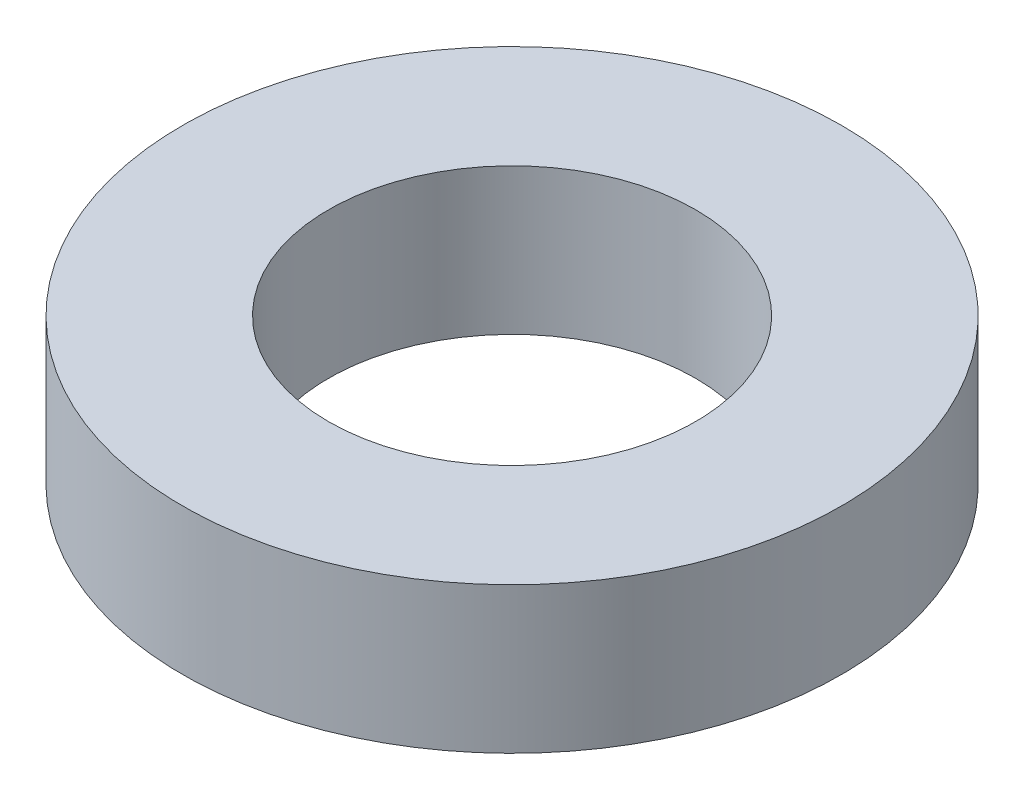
ISO-10303-21;
HEADER;
FILE_DESCRIPTION(('STEP AP214'),'2;1');
FILE_NAME('part.step','',(''),(''),'','','');
FILE_SCHEMA(('AUTOMOTIVE_DESIGN { 1 0 10303 214 1 1 1 1 }'));
ENDSEC;
DATA;
#1=APPLICATION_CONTEXT('core data for automotive mechanical design processes');
#2=APPLICATION_PROTOCOL_DEFINITION('international standard','automotive_design',2000,#1);
#3=PRODUCT_CONTEXT('',#1,'mechanical');
#4=PRODUCT('Part','Part','',(#3));
#5=PRODUCT_RELATED_PRODUCT_CATEGORY('part','',(#4));
#6=PRODUCT_DEFINITION_FORMATION('','',#4);
#7=PRODUCT_DEFINITION_CONTEXT('part definition',#1,'design');
#8=PRODUCT_DEFINITION('design','',#6,#7);
#9=PRODUCT_DEFINITION_SHAPE('','',#8);
#10=(LENGTH_UNIT() NAMED_UNIT(*) SI_UNIT(.MILLI.,.METRE.));
#11=(NAMED_UNIT(*) PLANE_ANGLE_UNIT() SI_UNIT($,.RADIAN.));
#12=(NAMED_UNIT(*) SI_UNIT($,.STERADIAN.) SOLID_ANGLE_UNIT());
#13=UNCERTAINTY_MEASURE_WITH_UNIT(LENGTH_MEASURE(1.E-05),#10,'distance_accuracy_value','');
#14=(GEOMETRIC_REPRESENTATION_CONTEXT(3) GLOBAL_UNCERTAINTY_ASSIGNED_CONTEXT((#13)) GLOBAL_UNIT_ASSIGNED_CONTEXT((#10,
#11,#12)) REPRESENTATION_CONTEXT('',''));
#15=CARTESIAN_POINT('',(0.,0.,0.));
#16=DIRECTION('',(0.,0.,1.));
#17=DIRECTION('',(1.,0.,0.));
#18=AXIS2_PLACEMENT_3D('',#15,#16,#17);
#19=CARTESIAN_POINT('',(0.,0.,0.));
#20=DIRECTION('',(0.,-1.,0.));
#21=DIRECTION('',(0.,0.,-1.));
#22=AXIS2_PLACEMENT_3D('',#19,#20,#21);
#23=CYLINDRICAL_SURFACE('',#22,2.2352);
#24=CARTESIAN_POINT('',(0.,1.778,0.));
#25=DIRECTION('',(0.,-1.,0.));
#26=DIRECTION('',(0.,0.,-1.));
#27=AXIS2_PLACEMENT_3D('',#24,#25,#26);
#28=CIRCLE('',#27,2.2352);
#29=CARTESIAN_POINT('',(0.,1.778,-2.2352));
#30=VERTEX_POINT('',#29);
#31=EDGE_CURVE('E52',#30,#30,#28,.T.);
#32=ORIENTED_EDGE('',*,*,#31,.F.);
#33=EDGE_LOOP('',(#32));
#34=FACE_BOUND('',#33,.T.);
#35=CARTESIAN_POINT('',(0.,0.,0.));
#36=DIRECTION('',(0.,-1.,0.));
#37=DIRECTION('',(0.,0.,-1.));
#38=AXIS2_PLACEMENT_3D('',#35,#36,#37);
#39=CIRCLE('',#38,2.2352);
#40=CARTESIAN_POINT('',(0.,0.,-2.2352));
#41=VERTEX_POINT('',#40);
#42=EDGE_CURVE('E10',#41,#41,#39,.T.);
#43=ORIENTED_EDGE('',*,*,#42,.T.);
#44=EDGE_LOOP('',(#43));
#45=FACE_BOUND('',#44,.T.);
#46=ADVANCED_FACE('F34',(#34,#45),#23,.F.);
#47=CARTESIAN_POINT('',(-2.2352,0.,0.));
#48=DIRECTION('',(0.,1.,0.));
#49=DIRECTION('',(0.,0.,1.));
#50=AXIS2_PLACEMENT_3D('',#47,#48,#49);
#51=PLANE('',#50);
#52=ORIENTED_EDGE('',*,*,#42,.F.);
#53=EDGE_LOOP('',(#52));
#54=FACE_BOUND('',#53,.T.);
#55=CARTESIAN_POINT('',(0.,0.,0.));
#56=DIRECTION('',(0.,-1.,0.));
#57=DIRECTION('',(0.,0.,-1.));
#58=AXIS2_PLACEMENT_3D('',#55,#56,#57);
#59=CIRCLE('',#58,4.0132);
#60=CARTESIAN_POINT('',(0.,0.,-4.0132));
#61=VERTEX_POINT('',#60);
#62=EDGE_CURVE('E41',#61,#61,#59,.T.);
#63=ORIENTED_EDGE('',*,*,#62,.T.);
#64=EDGE_LOOP('',(#63));
#65=FACE_BOUND('',#64,.T.);
#66=ADVANCED_FACE('F61',(#54,#65),#51,.F.);
#67=CARTESIAN_POINT('',(0.,0.,0.));
#68=DIRECTION('',(0.,-1.,0.));
#69=DIRECTION('',(0.,0.,-1.));
#70=AXIS2_PLACEMENT_3D('',#67,#68,#69);
#71=CYLINDRICAL_SURFACE('',#70,4.0132);
#72=ORIENTED_EDGE('',*,*,#62,.F.);
#73=EDGE_LOOP('',(#72));
#74=FACE_BOUND('',#73,.T.);
#75=CARTESIAN_POINT('',(0.,1.778,0.));
#76=DIRECTION('',(0.,-1.,0.));
#77=DIRECTION('',(0.,0.,-1.));
#78=AXIS2_PLACEMENT_3D('',#75,#76,#77);
#79=CIRCLE('',#78,4.0132);
#80=CARTESIAN_POINT('',(0.,1.778,-4.0132));
#81=VERTEX_POINT('',#80);
#82=EDGE_CURVE('E47',#81,#81,#79,.T.);
#83=ORIENTED_EDGE('',*,*,#82,.T.);
#84=EDGE_LOOP('',(#83));
#85=FACE_BOUND('',#84,.T.);
#86=ADVANCED_FACE('F65',(#74,#85),#71,.T.);
#87=CARTESIAN_POINT('',(-2.2352,1.778,0.));
#88=DIRECTION('',(0.,-1.,0.));
#89=DIRECTION('',(0.,0.,-1.));
#90=AXIS2_PLACEMENT_3D('',#87,#88,#89);
#91=PLANE('',#90);
#92=ORIENTED_EDGE('',*,*,#82,.F.);
#93=EDGE_LOOP('',(#92));
#94=FACE_BOUND('',#93,.T.);
#95=ORIENTED_EDGE('',*,*,#31,.T.);
#96=EDGE_LOOP('',(#95));
#97=FACE_BOUND('',#96,.T.);
#98=ADVANCED_FACE('F58',(#94,#97),#91,.F.);
#99=CLOSED_SHELL('',(#46,#66,#86,#98));
#100=MANIFOLD_SOLID_BREP('B2',#99);
#101=ADVANCED_BREP_SHAPE_REPRESENTATION('',(#18,#100),#14);
#102=SHAPE_DEFINITION_REPRESENTATION(#9,#101);
ENDSEC;
END-ISO-10303-21;
